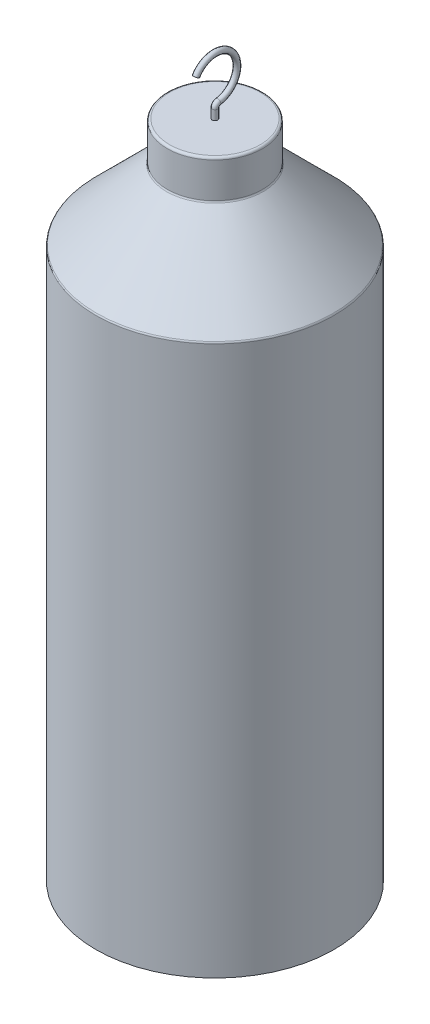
from build123d import *

# Parameters (mm, degrees)
SKETCH_3_R = 0.75


with BuildPart() as part:
    # Sketch 1 → Revolve 1 (revolve)
    with BuildSketch(Plane(origin=(0, 0, 0), x_dir=(0, 0, -1), z_dir=(1, 0, 0)), mode=Mode.PRIVATE) as revolve_1_sk:
        with BuildLine():
            Line((0, 0), (32.5, 0))
            Line((32.5, 0), (32.5, 149.736974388))
            ThreePointArc((32.5, 149.736974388), (32.451663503, 149.979978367), (32.314012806, 150.185987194))
            Line((32.314012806, 150.185987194), (13.185987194, 169.314012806))
            ThreePointArc((13.185987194, 169.314012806), (13.048336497, 169.520021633), (13, 169.763025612))
            Line((13, 169.763025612), (13, 179.365))
            ThreePointArc((13, 179.365), (12.814012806, 179.814012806), (12.365, 180))
            Line((12.365, 180), (0.75, 180))
            Line((0.75, 180), (0.75, 169.5))
            Line((0.75, 169.5), (0, 169.5))
            Line((0, 169.5), (0, 0))
        make_face()
    revolve(revolve_1_sk.sketch.rotate(Axis((0, 169.5, 0), (0, -1, 0)), 180), axis=Axis((0, 169.5, 0), (0, -1, 0)))


with BuildPart() as body_2:
    # Sweep 1: sweep along a path in Sketch 2
    with BuildLine(Plane(origin=(0, 0, 0), x_dir=(0, 0, -1), z_dir=(1, 0, 0))) as sweep_1_path:
        Line((0, 169.5), (0, 182.57179677))
        ThreePointArc((0, 182.57179677), (0.244071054, 183.22645044), (0.857142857, 183.561540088))
        ThreePointArc((0.857142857, 183.561540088), (4.967974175, 192.864406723), (-5.196152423, 192.5))
    # Sketch 3 → Sweep 1 (sweep)
    with BuildSketch(Plane(origin=(0, 169.5, 0), x_dir=(-1, 0, 0), z_dir=(0, 1, 0))):
        Circle(SKETCH_3_R)
    sweep(path=sweep_1_path.line)


solid = Compound([part.part, body_2.part])
